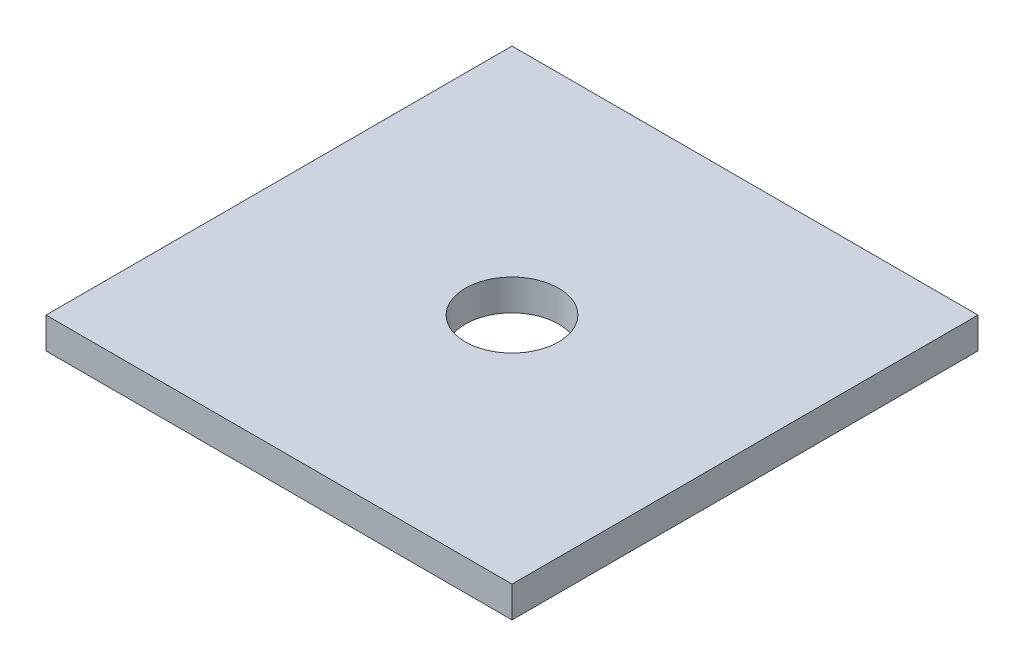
from build123d import *

# Parameters (mm, degrees)
SKETCH1_W      = 45
SKETCH1_H      = 45
SKETCH1_R      = 4.5
EXTRUDE1_DEPTH = 3


with BuildPart() as part:
    # Sketch1 → Extrude1 (new body)
    with BuildSketch(Plane(origin=(0, 0, 0), x_dir=(1, 0, 0), z_dir=(0, 1, 0))):
        with Locations((22.5, 22.5)):
            Rectangle(SKETCH1_W, SKETCH1_H)
        with Locations(Location((22.5, 22.5, 0), (0, 0, 270))):
            Circle(SKETCH1_R, mode=Mode.SUBTRACT)
    extrude(amount=EXTRUDE1_DEPTH)


solid = part.part
